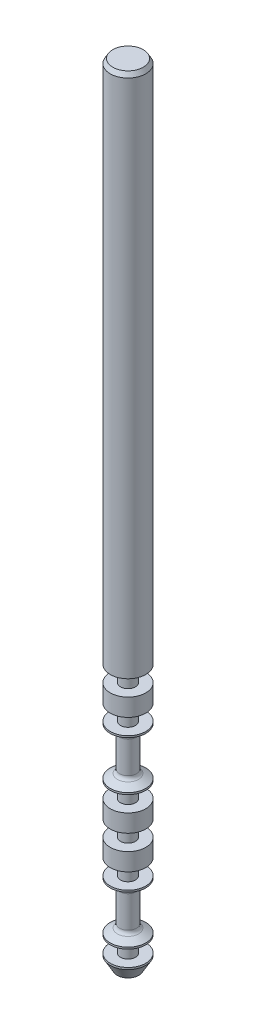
ISO-10303-21;
HEADER;
FILE_DESCRIPTION(('STEP AP214'),'2;1');
FILE_NAME('part.step','',(''),(''),'','','');
FILE_SCHEMA(('AUTOMOTIVE_DESIGN { 1 0 10303 214 1 1 1 1 }'));
ENDSEC;
DATA;
#1=APPLICATION_CONTEXT('core data for automotive mechanical design processes');
#2=APPLICATION_PROTOCOL_DEFINITION('international standard','automotive_design',2000,#1);
#3=PRODUCT_CONTEXT('',#1,'mechanical');
#4=PRODUCT('Part','Part','',(#3));
#5=PRODUCT_RELATED_PRODUCT_CATEGORY('part','',(#4));
#6=PRODUCT_DEFINITION_FORMATION('','',#4);
#7=PRODUCT_DEFINITION_CONTEXT('part definition',#1,'design');
#8=PRODUCT_DEFINITION('design','',#6,#7);
#9=PRODUCT_DEFINITION_SHAPE('','',#8);
#10=(LENGTH_UNIT() NAMED_UNIT(*) SI_UNIT(.MILLI.,.METRE.));
#11=(NAMED_UNIT(*) PLANE_ANGLE_UNIT() SI_UNIT($,.RADIAN.));
#12=(NAMED_UNIT(*) SI_UNIT($,.STERADIAN.) SOLID_ANGLE_UNIT());
#13=UNCERTAINTY_MEASURE_WITH_UNIT(LENGTH_MEASURE(1.E-05),#10,'distance_accuracy_value','');
#14=(GEOMETRIC_REPRESENTATION_CONTEXT(3) GLOBAL_UNCERTAINTY_ASSIGNED_CONTEXT((#13)) GLOBAL_UNIT_ASSIGNED_CONTEXT((#10,
#11,#12)) REPRESENTATION_CONTEXT('',''));
#15=CARTESIAN_POINT('',(0.,0.,0.));
#16=DIRECTION('',(0.,0.,1.));
#17=DIRECTION('',(1.,0.,0.));
#18=AXIS2_PLACEMENT_3D('',#15,#16,#17);
#19=CARTESIAN_POINT('',(58.02,-2.4,1.65));
#20=DIRECTION('',(0.,1.,0.));
#21=DIRECTION('',(0.,0.,1.));
#22=AXIS2_PLACEMENT_3D('',#19,#20,#21);
#23=PLANE('',#22);
#24=CARTESIAN_POINT('',(56.,-2.4,1.65));
#25=DIRECTION('',(0.,1.,0.));
#26=DIRECTION('',(0.,0.,1.));
#27=AXIS2_PLACEMENT_3D('',#24,#25,#26);
#28=CIRCLE('',#27,1.73132486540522);
#29=CARTESIAN_POINT('',(56.,-2.4,3.38132486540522));
#30=VERTEX_POINT('',#29);
#31=EDGE_CURVE('E10',#30,#30,#28,.T.);
#32=ORIENTED_EDGE('',*,*,#31,.T.);
#33=EDGE_LOOP('',(#32));
#34=FACE_BOUND('',#33,.T.);
#35=ADVANCED_FACE('F37',(#34),#23,.T.);
#36=CARTESIAN_POINT('',(56.,-1065.45754338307,1.65));
#37=DIRECTION('',(0.,-1.,0.));
#38=DIRECTION('',(0.,0.,-1.));
#39=AXIS2_PLACEMENT_3D('',#36,#37,#38);
#40=CYLINDRICAL_SURFACE('',#39,2.02);
#41=CARTESIAN_POINT('',(56.,-2.8999999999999,1.65));
#42=DIRECTION('',(0.,1.,0.));
#43=DIRECTION('',(0.,0.,1.));
#44=AXIS2_PLACEMENT_3D('',#41,#42,#43);
#45=CIRCLE('',#44,2.02);
#46=CARTESIAN_POINT('',(56.,-2.8999999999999,3.67));
#47=VERTEX_POINT('',#46);
#48=EDGE_CURVE('E45',#47,#47,#45,.F.);
#49=ORIENTED_EDGE('',*,*,#48,.T.);
#50=EDGE_LOOP('',(#49));
#51=FACE_BOUND('',#50,.T.);
#52=CARTESIAN_POINT('',(56.,-62.0000000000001,1.65));
#53=DIRECTION('',(0.,-1.,0.));
#54=DIRECTION('',(0.,0.,-1.));
#55=AXIS2_PLACEMENT_3D('',#52,#53,#54);
#56=CIRCLE('',#55,2.02000000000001);
#57=CARTESIAN_POINT('',(56.,-62.0000000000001,-0.370000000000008));
#58=VERTEX_POINT('',#57);
#59=EDGE_CURVE('E93',#58,#58,#56,.T.);
#60=ORIENTED_EDGE('',*,*,#59,.F.);
#61=EDGE_LOOP('',(#60));
#62=FACE_BOUND('',#61,.T.);
#63=ADVANCED_FACE('F224',(#51,#62),#40,.T.);
#64=CARTESIAN_POINT('',(56.85,-62.,1.65));
#65=DIRECTION('',(0.,-1.,0.));
#66=DIRECTION('',(0.,0.,-1.));
#67=AXIS2_PLACEMENT_3D('',#64,#65,#66);
#68=PLANE('',#67);
#69=ORIENTED_EDGE('',*,*,#59,.T.);
#70=EDGE_LOOP('',(#69));
#71=FACE_BOUND('',#70,.T.);
#72=CARTESIAN_POINT('',(56.,-62.0000000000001,1.65));
#73=DIRECTION('',(0.,-1.,0.));
#74=DIRECTION('',(0.,0.,-1.));
#75=AXIS2_PLACEMENT_3D('',#72,#73,#74);
#76=CIRCLE('',#75,0.849999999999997);
#77=CARTESIAN_POINT('',(56.,-62.0000000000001,0.800000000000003));
#78=VERTEX_POINT('',#77);
#79=EDGE_CURVE('E97',#78,#78,#76,.T.);
#80=ORIENTED_EDGE('',*,*,#79,.F.);
#81=EDGE_LOOP('',(#80));
#82=FACE_BOUND('',#81,.T.);
#83=ADVANCED_FACE('F229',(#71,#82),#68,.T.);
#84=CARTESIAN_POINT('',(56.,-1065.45754338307,1.65));
#85=DIRECTION('',(0.,-1.,0.));
#86=DIRECTION('',(0.,0.,-1.));
#87=AXIS2_PLACEMENT_3D('',#84,#85,#86);
#88=CYLINDRICAL_SURFACE('',#87,0.849999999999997);
#89=ORIENTED_EDGE('',*,*,#79,.T.);
#90=EDGE_LOOP('',(#89));
#91=FACE_BOUND('',#90,.T.);
#92=CARTESIAN_POINT('',(56.,-63.8000000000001,1.65));
#93=DIRECTION('',(0.,-1.,0.));
#94=DIRECTION('',(0.,0.,-1.));
#95=AXIS2_PLACEMENT_3D('',#92,#93,#94);
#96=CIRCLE('',#95,0.849999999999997);
#97=CARTESIAN_POINT('',(56.,-63.8000000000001,0.800000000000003));
#98=VERTEX_POINT('',#97);
#99=EDGE_CURVE('E101',#98,#98,#96,.T.);
#100=ORIENTED_EDGE('',*,*,#99,.F.);
#101=EDGE_LOOP('',(#100));
#102=FACE_BOUND('',#101,.T.);
#103=ADVANCED_FACE('F547',(#91,#102),#88,.T.);
#104=CARTESIAN_POINT('',(58.02,-63.8,1.65));
#105=DIRECTION('',(0.,1.,0.));
#106=DIRECTION('',(0.,0.,1.));
#107=AXIS2_PLACEMENT_3D('',#104,#105,#106);
#108=PLANE('',#107);
#109=ORIENTED_EDGE('',*,*,#99,.T.);
#110=EDGE_LOOP('',(#109));
#111=FACE_BOUND('',#110,.T.);
#112=CARTESIAN_POINT('',(56.,-63.8000000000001,1.65));
#113=DIRECTION('',(0.,-1.,0.));
#114=DIRECTION('',(0.,0.,-1.));
#115=AXIS2_PLACEMENT_3D('',#112,#113,#114);
#116=CIRCLE('',#115,2.02);
#117=CARTESIAN_POINT('',(56.,-63.8000000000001,-0.370000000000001));
#118=VERTEX_POINT('',#117);
#119=EDGE_CURVE('E105',#118,#118,#116,.T.);
#120=ORIENTED_EDGE('',*,*,#119,.F.);
#121=EDGE_LOOP('',(#120));
#122=FACE_BOUND('',#121,.T.);
#123=ADVANCED_FACE('F538',(#111,#122),#108,.T.);
#124=CARTESIAN_POINT('',(56.,-1065.45754338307,1.65));
#125=DIRECTION('',(0.,-1.,0.));
#126=DIRECTION('',(0.,0.,-1.));
#127=AXIS2_PLACEMENT_3D('',#124,#125,#126);
#128=CYLINDRICAL_SURFACE('',#127,2.02);
#129=ORIENTED_EDGE('',*,*,#119,.T.);
#130=EDGE_LOOP('',(#129));
#131=FACE_BOUND('',#130,.T.);
#132=CARTESIAN_POINT('',(56.,-65.8,1.65));
#133=DIRECTION('',(0.,-1.,0.));
#134=DIRECTION('',(0.,0.,-1.));
#135=AXIS2_PLACEMENT_3D('',#132,#133,#134);
#136=CIRCLE('',#135,2.02);
#137=CARTESIAN_POINT('',(56.,-65.8,-0.370000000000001));
#138=VERTEX_POINT('',#137);
#139=EDGE_CURVE('E109',#138,#138,#136,.T.);
#140=ORIENTED_EDGE('',*,*,#139,.F.);
#141=EDGE_LOOP('',(#140));
#142=FACE_BOUND('',#141,.T.);
#143=ADVANCED_FACE('F529',(#131,#142),#128,.T.);
#144=CARTESIAN_POINT('',(58.02,-65.8,1.65));
#145=DIRECTION('',(0.,-1.,0.));
#146=DIRECTION('',(0.,0.,-1.));
#147=AXIS2_PLACEMENT_3D('',#144,#145,#146);
#148=PLANE('',#147);
#149=ORIENTED_EDGE('',*,*,#139,.T.);
#150=EDGE_LOOP('',(#149));
#151=FACE_BOUND('',#150,.T.);
#152=CARTESIAN_POINT('',(56.,-65.8,1.65));
#153=DIRECTION('',(0.,-1.,0.));
#154=DIRECTION('',(0.,0.,-1.));
#155=AXIS2_PLACEMENT_3D('',#152,#153,#154);
#156=CIRCLE('',#155,0.849999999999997);
#157=CARTESIAN_POINT('',(56.,-65.8,0.800000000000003));
#158=VERTEX_POINT('',#157);
#159=EDGE_CURVE('E113',#158,#158,#156,.T.);
#160=ORIENTED_EDGE('',*,*,#159,.F.);
#161=EDGE_LOOP('',(#160));
#162=FACE_BOUND('',#161,.T.);
#163=ADVANCED_FACE('F520',(#151,#162),#148,.T.);
#164=CARTESIAN_POINT('',(56.,-1065.45754338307,1.65));
#165=DIRECTION('',(0.,-1.,0.));
#166=DIRECTION('',(0.,0.,-1.));
#167=AXIS2_PLACEMENT_3D('',#164,#165,#166);
#168=CYLINDRICAL_SURFACE('',#167,0.849999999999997);
#169=ORIENTED_EDGE('',*,*,#159,.T.);
#170=EDGE_LOOP('',(#169));
#171=FACE_BOUND('',#170,.T.);
#172=CARTESIAN_POINT('',(56.,-67.6,1.65));
#173=DIRECTION('',(0.,-1.,0.));
#174=DIRECTION('',(0.,0.,-1.));
#175=AXIS2_PLACEMENT_3D('',#172,#173,#174);
#176=CIRCLE('',#175,0.849999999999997);
#177=CARTESIAN_POINT('',(56.,-67.6,0.800000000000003));
#178=VERTEX_POINT('',#177);
#179=EDGE_CURVE('E117',#178,#178,#176,.T.);
#180=ORIENTED_EDGE('',*,*,#179,.F.);
#181=EDGE_LOOP('',(#180));
#182=FACE_BOUND('',#181,.T.);
#183=ADVANCED_FACE('F511',(#171,#182),#168,.T.);
#184=CARTESIAN_POINT('',(56.85,-67.6,1.65));
#185=DIRECTION('',(0.,1.,0.));
#186=DIRECTION('',(0.,0.,1.));
#187=AXIS2_PLACEMENT_3D('',#184,#185,#186);
#188=PLANE('',#187);
#189=ORIENTED_EDGE('',*,*,#179,.T.);
#190=EDGE_LOOP('',(#189));
#191=FACE_BOUND('',#190,.T.);
#192=CARTESIAN_POINT('',(56.,-67.6,1.65));
#193=DIRECTION('',(0.,-1.,0.));
#194=DIRECTION('',(0.,0.,-1.));
#195=AXIS2_PLACEMENT_3D('',#192,#193,#194);
#196=CIRCLE('',#195,2.02);
#197=CARTESIAN_POINT('',(56.,-67.6,-0.370000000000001));
#198=VERTEX_POINT('',#197);
#199=EDGE_CURVE('E121',#198,#198,#196,.T.);
#200=ORIENTED_EDGE('',*,*,#199,.F.);
#201=EDGE_LOOP('',(#200));
#202=FACE_BOUND('',#201,.T.);
#203=ADVANCED_FACE('F502',(#191,#202),#188,.T.);
#204=CARTESIAN_POINT('',(56.,-1065.45754338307,1.65));
#205=DIRECTION('',(0.,-1.,0.));
#206=DIRECTION('',(0.,0.,-1.));
#207=AXIS2_PLACEMENT_3D('',#204,#205,#206);
#208=CYLINDRICAL_SURFACE('',#207,2.02);
#209=ORIENTED_EDGE('',*,*,#199,.T.);
#210=EDGE_LOOP('',(#209));
#211=FACE_BOUND('',#210,.T.);
#212=CARTESIAN_POINT('',(56.,-67.8,1.65));
#213=DIRECTION('',(0.,-1.,0.));
#214=DIRECTION('',(0.,0.,-1.));
#215=AXIS2_PLACEMENT_3D('',#212,#213,#214);
#216=CIRCLE('',#215,2.02);
#217=CARTESIAN_POINT('',(56.,-67.8,-0.370000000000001));
#218=VERTEX_POINT('',#217);
#219=EDGE_CURVE('E125',#218,#218,#216,.T.);
#220=ORIENTED_EDGE('',*,*,#219,.F.);
#221=EDGE_LOOP('',(#220));
#222=FACE_BOUND('',#221,.T.);
#223=ADVANCED_FACE('F494',(#211,#222),#208,.T.);
#224=CARTESIAN_POINT('',(56.,-68.4177647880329,1.65));
#225=DIRECTION('',(0.,1.,0.));
#226=DIRECTION('',(0.,0.,1.));
#227=AXIS2_PLACEMENT_3D('',#224,#225,#226);
#228=CONICAL_SURFACE('',#227,0.95,1.04719755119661);
#229=CARTESIAN_POINT('',(56.,-68.2734272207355,1.65));
#230=DIRECTION('',(0.,1.,0.));
#231=DIRECTION('',(0.,0.,1.));
#232=AXIS2_PLACEMENT_3D('',#229,#230,#231);
#233=CIRCLE('',#232,1.19999999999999);
#234=CARTESIAN_POINT('',(56.,-68.2734272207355,2.84999999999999));
#235=VERTEX_POINT('',#234);
#236=EDGE_CURVE('E61',#235,#235,#233,.T.);
#237=ORIENTED_EDGE('',*,*,#236,.T.);
#238=EDGE_LOOP('',(#237));
#239=FACE_BOUND('',#238,.T.);
#240=ORIENTED_EDGE('',*,*,#219,.T.);
#241=EDGE_LOOP('',(#240));
#242=FACE_BOUND('',#241,.T.);
#243=ADVANCED_FACE('F486',(#239,#242),#228,.T.);
#244=CARTESIAN_POINT('',(56.,-1065.45754338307,1.65));
#245=DIRECTION('',(0.,-1.,0.));
#246=DIRECTION('',(0.,0.,-1.));
#247=AXIS2_PLACEMENT_3D('',#244,#245,#246);
#248=CYLINDRICAL_SURFACE('',#247,0.95);
#249=CARTESIAN_POINT('',(56.,-72.2935600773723,1.65));
#250=DIRECTION('',(0.,-1.,0.));
#251=DIRECTION('',(0.,0.,-1.));
#252=AXIS2_PLACEMENT_3D('',#249,#250,#251);
#253=CIRCLE('',#252,0.95);
#254=CARTESIAN_POINT('',(56.,-72.2935600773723,0.700000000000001));
#255=VERTEX_POINT('',#254);
#256=EDGE_CURVE('E65',#255,#255,#253,.F.);
#257=ORIENTED_EDGE('',*,*,#256,.T.);
#258=EDGE_LOOP('',(#257));
#259=FACE_BOUND('',#258,.T.);
#260=CARTESIAN_POINT('',(56.,-68.7064399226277,1.65));
#261=DIRECTION('',(0.,-1.,0.));
#262=DIRECTION('',(0.,0.,-1.));
#263=AXIS2_PLACEMENT_3D('',#260,#261,#262);
#264=CIRCLE('',#263,0.95);
#265=CARTESIAN_POINT('',(56.,-68.7064399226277,0.700000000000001));
#266=VERTEX_POINT('',#265);
#267=EDGE_CURVE('E69',#266,#266,#264,.T.);
#268=ORIENTED_EDGE('',*,*,#267,.T.);
#269=EDGE_LOOP('',(#268));
#270=FACE_BOUND('',#269,.T.);
#271=ADVANCED_FACE('F477',(#259,#270),#248,.T.);
#272=CARTESIAN_POINT('',(56.,-73.2,1.65));
#273=DIRECTION('',(0.,-1.,0.));
#274=DIRECTION('',(0.,0.,-1.));
#275=AXIS2_PLACEMENT_3D('',#272,#273,#274);
#276=CONICAL_SURFACE('',#275,2.02,1.04719755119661);
#277=CARTESIAN_POINT('',(56.,-72.7265727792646,1.65));
#278=DIRECTION('',(0.,-1.,0.));
#279=DIRECTION('',(0.,0.,-1.));
#280=AXIS2_PLACEMENT_3D('',#277,#278,#279);
#281=CIRCLE('',#280,1.19999999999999);
#282=CARTESIAN_POINT('',(56.,-72.7265727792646,0.450000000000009));
#283=VERTEX_POINT('',#282);
#284=EDGE_CURVE('E73',#283,#283,#281,.T.);
#285=ORIENTED_EDGE('',*,*,#284,.T.);
#286=EDGE_LOOP('',(#285));
#287=FACE_BOUND('',#286,.T.);
#288=CARTESIAN_POINT('',(56.,-73.2,1.65));
#289=DIRECTION('',(0.,-1.,0.));
#290=DIRECTION('',(0.,0.,-1.));
#291=AXIS2_PLACEMENT_3D('',#288,#289,#290);
#292=CIRCLE('',#291,2.02);
#293=CARTESIAN_POINT('',(56.,-73.2,-0.370000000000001));
#294=VERTEX_POINT('',#293);
#295=EDGE_CURVE('E129',#294,#294,#292,.T.);
#296=ORIENTED_EDGE('',*,*,#295,.F.);
#297=EDGE_LOOP('',(#296));
#298=FACE_BOUND('',#297,.T.);
#299=ADVANCED_FACE('F468',(#287,#298),#276,.T.);
#300=CARTESIAN_POINT('',(56.,-1065.45754338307,1.65));
#301=DIRECTION('',(0.,-1.,0.));
#302=DIRECTION('',(0.,0.,-1.));
#303=AXIS2_PLACEMENT_3D('',#300,#301,#302);
#304=CYLINDRICAL_SURFACE('',#303,2.02);
#305=ORIENTED_EDGE('',*,*,#295,.T.);
#306=EDGE_LOOP('',(#305));
#307=FACE_BOUND('',#306,.T.);
#308=CARTESIAN_POINT('',(56.,-73.4,1.65));
#309=DIRECTION('',(0.,-1.,0.));
#310=DIRECTION('',(0.,0.,-1.));
#311=AXIS2_PLACEMENT_3D('',#308,#309,#310);
#312=CIRCLE('',#311,2.02);
#313=CARTESIAN_POINT('',(56.,-73.4,-0.370000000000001));
#314=VERTEX_POINT('',#313);
#315=EDGE_CURVE('E133',#314,#314,#312,.T.);
#316=ORIENTED_EDGE('',*,*,#315,.F.);
#317=EDGE_LOOP('',(#316));
#318=FACE_BOUND('',#317,.T.);
#319=ADVANCED_FACE('F459',(#307,#318),#304,.T.);
#320=CARTESIAN_POINT('',(58.02,-73.4,1.65));
#321=DIRECTION('',(0.,-1.,0.));
#322=DIRECTION('',(0.,0.,-1.));
#323=AXIS2_PLACEMENT_3D('',#320,#321,#322);
#324=PLANE('',#323);
#325=ORIENTED_EDGE('',*,*,#315,.T.);
#326=EDGE_LOOP('',(#325));
#327=FACE_BOUND('',#326,.T.);
#328=CARTESIAN_POINT('',(56.,-73.4,1.65));
#329=DIRECTION('',(0.,-1.,0.));
#330=DIRECTION('',(0.,0.,-1.));
#331=AXIS2_PLACEMENT_3D('',#328,#329,#330);
#332=CIRCLE('',#331,0.849999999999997);
#333=CARTESIAN_POINT('',(56.,-73.4,0.800000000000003));
#334=VERTEX_POINT('',#333);
#335=EDGE_CURVE('E137',#334,#334,#332,.T.);
#336=ORIENTED_EDGE('',*,*,#335,.F.);
#337=EDGE_LOOP('',(#336));
#338=FACE_BOUND('',#337,.T.);
#339=ADVANCED_FACE('F450',(#327,#338),#324,.T.);
#340=CARTESIAN_POINT('',(56.,-1065.45754338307,1.65));
#341=DIRECTION('',(0.,-1.,0.));
#342=DIRECTION('',(0.,0.,-1.));
#343=AXIS2_PLACEMENT_3D('',#340,#341,#342);
#344=CYLINDRICAL_SURFACE('',#343,0.849999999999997);
#345=ORIENTED_EDGE('',*,*,#335,.T.);
#346=EDGE_LOOP('',(#345));
#347=FACE_BOUND('',#346,.T.);
#348=CARTESIAN_POINT('',(56.,-75.2,1.65));
#349=DIRECTION('',(0.,-1.,0.));
#350=DIRECTION('',(0.,0.,-1.));
#351=AXIS2_PLACEMENT_3D('',#348,#349,#350);
#352=CIRCLE('',#351,0.849999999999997);
#353=CARTESIAN_POINT('',(56.,-75.2,0.800000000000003));
#354=VERTEX_POINT('',#353);
#355=EDGE_CURVE('E141',#354,#354,#352,.T.);
#356=ORIENTED_EDGE('',*,*,#355,.F.);
#357=EDGE_LOOP('',(#356));
#358=FACE_BOUND('',#357,.T.);
#359=ADVANCED_FACE('F441',(#347,#358),#344,.T.);
#360=CARTESIAN_POINT('',(56.85,-75.2,1.65));
#361=DIRECTION('',(0.,1.,0.));
#362=DIRECTION('',(0.,0.,1.));
#363=AXIS2_PLACEMENT_3D('',#360,#361,#362);
#364=PLANE('',#363);
#365=ORIENTED_EDGE('',*,*,#355,.T.);
#366=EDGE_LOOP('',(#365));
#367=FACE_BOUND('',#366,.T.);
#368=CARTESIAN_POINT('',(56.,-75.2,1.65));
#369=DIRECTION('',(0.,-1.,0.));
#370=DIRECTION('',(0.,0.,-1.));
#371=AXIS2_PLACEMENT_3D('',#368,#369,#370);
#372=CIRCLE('',#371,2.02);
#373=CARTESIAN_POINT('',(56.,-75.2,-0.370000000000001));
#374=VERTEX_POINT('',#373);
#375=EDGE_CURVE('E145',#374,#374,#372,.T.);
#376=ORIENTED_EDGE('',*,*,#375,.F.);
#377=EDGE_LOOP('',(#376));
#378=FACE_BOUND('',#377,.T.);
#379=ADVANCED_FACE('F432',(#367,#378),#364,.T.);
#380=CARTESIAN_POINT('',(56.,-1065.45754338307,1.65));
#381=DIRECTION('',(0.,-1.,0.));
#382=DIRECTION('',(0.,0.,-1.));
#383=AXIS2_PLACEMENT_3D('',#380,#381,#382);
#384=CYLINDRICAL_SURFACE('',#383,2.02);
#385=ORIENTED_EDGE('',*,*,#375,.T.);
#386=EDGE_LOOP('',(#385));
#387=FACE_BOUND('',#386,.T.);
#388=CARTESIAN_POINT('',(56.,-77.2,1.65));
#389=DIRECTION('',(0.,-1.,0.));
#390=DIRECTION('',(0.,0.,-1.));
#391=AXIS2_PLACEMENT_3D('',#388,#389,#390);
#392=CIRCLE('',#391,2.02);
#393=CARTESIAN_POINT('',(56.,-77.2,-0.370000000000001));
#394=VERTEX_POINT('',#393);
#395=EDGE_CURVE('E149',#394,#394,#392,.T.);
#396=ORIENTED_EDGE('',*,*,#395,.F.);
#397=EDGE_LOOP('',(#396));
#398=FACE_BOUND('',#397,.T.);
#399=ADVANCED_FACE('F423',(#387,#398),#384,.T.);
#400=CARTESIAN_POINT('',(58.02,-77.2,1.65));
#401=DIRECTION('',(0.,-1.,0.));
#402=DIRECTION('',(0.,0.,-1.));
#403=AXIS2_PLACEMENT_3D('',#400,#401,#402);
#404=PLANE('',#403);
#405=ORIENTED_EDGE('',*,*,#395,.T.);
#406=EDGE_LOOP('',(#405));
#407=FACE_BOUND('',#406,.T.);
#408=CARTESIAN_POINT('',(56.,-77.2,1.65));
#409=DIRECTION('',(0.,-1.,0.));
#410=DIRECTION('',(0.,0.,-1.));
#411=AXIS2_PLACEMENT_3D('',#408,#409,#410);
#412=CIRCLE('',#411,0.849999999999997);
#413=CARTESIAN_POINT('',(56.,-77.2,0.800000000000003));
#414=VERTEX_POINT('',#413);
#415=EDGE_CURVE('E153',#414,#414,#412,.T.);
#416=ORIENTED_EDGE('',*,*,#415,.F.);
#417=EDGE_LOOP('',(#416));
#418=FACE_BOUND('',#417,.T.);
#419=ADVANCED_FACE('F414',(#407,#418),#404,.T.);
#420=CARTESIAN_POINT('',(56.,-1065.45754338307,1.65));
#421=DIRECTION('',(0.,-1.,0.));
#422=DIRECTION('',(0.,0.,-1.));
#423=AXIS2_PLACEMENT_3D('',#420,#421,#422);
#424=CYLINDRICAL_SURFACE('',#423,0.849999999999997);
#425=ORIENTED_EDGE('',*,*,#415,.T.);
#426=EDGE_LOOP('',(#425));
#427=FACE_BOUND('',#426,.T.);
#428=CARTESIAN_POINT('',(56.,-79.,1.65));
#429=DIRECTION('',(0.,-1.,0.));
#430=DIRECTION('',(0.,0.,-1.));
#431=AXIS2_PLACEMENT_3D('',#428,#429,#430);
#432=CIRCLE('',#431,0.849999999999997);
#433=CARTESIAN_POINT('',(56.,-79.,0.800000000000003));
#434=VERTEX_POINT('',#433);
#435=EDGE_CURVE('E157',#434,#434,#432,.T.);
#436=ORIENTED_EDGE('',*,*,#435,.F.);
#437=EDGE_LOOP('',(#436));
#438=FACE_BOUND('',#437,.T.);
#439=ADVANCED_FACE('F405',(#427,#438),#424,.T.);
#440=CARTESIAN_POINT('',(56.85,-79.,1.65));
#441=DIRECTION('',(0.,1.,0.));
#442=DIRECTION('',(0.,0.,1.));
#443=AXIS2_PLACEMENT_3D('',#440,#441,#442);
#444=PLANE('',#443);
#445=ORIENTED_EDGE('',*,*,#435,.T.);
#446=EDGE_LOOP('',(#445));
#447=FACE_BOUND('',#446,.T.);
#448=CARTESIAN_POINT('',(56.,-79.,1.65));
#449=DIRECTION('',(0.,-1.,0.));
#450=DIRECTION('',(0.,0.,-1.));
#451=AXIS2_PLACEMENT_3D('',#448,#449,#450);
#452=CIRCLE('',#451,2.02);
#453=CARTESIAN_POINT('',(56.,-79.,-0.370000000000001));
#454=VERTEX_POINT('',#453);
#455=EDGE_CURVE('E161',#454,#454,#452,.T.);
#456=ORIENTED_EDGE('',*,*,#455,.F.);
#457=EDGE_LOOP('',(#456));
#458=FACE_BOUND('',#457,.T.);
#459=ADVANCED_FACE('F396',(#447,#458),#444,.T.);
#460=CARTESIAN_POINT('',(56.,-1065.45754338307,1.65));
#461=DIRECTION('',(0.,-1.,0.));
#462=DIRECTION('',(0.,0.,-1.));
#463=AXIS2_PLACEMENT_3D('',#460,#461,#462);
#464=CYLINDRICAL_SURFACE('',#463,2.02);
#465=ORIENTED_EDGE('',*,*,#455,.T.);
#466=EDGE_LOOP('',(#465));
#467=FACE_BOUND('',#466,.T.);
#468=CARTESIAN_POINT('',(56.,-81.,1.65));
#469=DIRECTION('',(0.,-1.,0.));
#470=DIRECTION('',(0.,0.,-1.));
#471=AXIS2_PLACEMENT_3D('',#468,#469,#470);
#472=CIRCLE('',#471,2.02);
#473=CARTESIAN_POINT('',(56.,-81.,-0.370000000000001));
#474=VERTEX_POINT('',#473);
#475=EDGE_CURVE('E165',#474,#474,#472,.T.);
#476=ORIENTED_EDGE('',*,*,#475,.F.);
#477=EDGE_LOOP('',(#476));
#478=FACE_BOUND('',#477,.T.);
#479=ADVANCED_FACE('F387',(#467,#478),#464,.T.);
#480=CARTESIAN_POINT('',(58.02,-81.,1.65));
#481=DIRECTION('',(0.,-1.,0.));
#482=DIRECTION('',(0.,0.,-1.));
#483=AXIS2_PLACEMENT_3D('',#480,#481,#482);
#484=PLANE('',#483);
#485=ORIENTED_EDGE('',*,*,#475,.T.);
#486=EDGE_LOOP('',(#485));
#487=FACE_BOUND('',#486,.T.);
#488=CARTESIAN_POINT('',(56.,-81.0000000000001,1.65));
#489=DIRECTION('',(0.,-1.,0.));
#490=DIRECTION('',(0.,0.,-1.));
#491=AXIS2_PLACEMENT_3D('',#488,#489,#490);
#492=CIRCLE('',#491,0.849999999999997);
#493=CARTESIAN_POINT('',(56.,-81.0000000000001,0.800000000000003));
#494=VERTEX_POINT('',#493);
#495=EDGE_CURVE('E169',#494,#494,#492,.T.);
#496=ORIENTED_EDGE('',*,*,#495,.F.);
#497=EDGE_LOOP('',(#496));
#498=FACE_BOUND('',#497,.T.);
#499=ADVANCED_FACE('F378',(#487,#498),#484,.T.);
#500=CARTESIAN_POINT('',(56.,-1065.45754338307,1.65));
#501=DIRECTION('',(0.,-1.,0.));
#502=DIRECTION('',(0.,0.,-1.));
#503=AXIS2_PLACEMENT_3D('',#500,#501,#502);
#504=CYLINDRICAL_SURFACE('',#503,0.849999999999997);
#505=ORIENTED_EDGE('',*,*,#495,.T.);
#506=EDGE_LOOP('',(#505));
#507=FACE_BOUND('',#506,.T.);
#508=CARTESIAN_POINT('',(56.,-82.8,1.65));
#509=DIRECTION('',(0.,-1.,0.));
#510=DIRECTION('',(0.,0.,-1.));
#511=AXIS2_PLACEMENT_3D('',#508,#509,#510);
#512=CIRCLE('',#511,0.849999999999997);
#513=CARTESIAN_POINT('',(56.,-82.8,0.800000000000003));
#514=VERTEX_POINT('',#513);
#515=EDGE_CURVE('E173',#514,#514,#512,.T.);
#516=ORIENTED_EDGE('',*,*,#515,.F.);
#517=EDGE_LOOP('',(#516));
#518=FACE_BOUND('',#517,.T.);
#519=ADVANCED_FACE('F369',(#507,#518),#504,.T.);
#520=CARTESIAN_POINT('',(56.85,-82.8,1.65));
#521=DIRECTION('',(0.,1.,0.));
#522=DIRECTION('',(0.,0.,1.));
#523=AXIS2_PLACEMENT_3D('',#520,#521,#522);
#524=PLANE('',#523);
#525=ORIENTED_EDGE('',*,*,#515,.T.);
#526=EDGE_LOOP('',(#525));
#527=FACE_BOUND('',#526,.T.);
#528=CARTESIAN_POINT('',(56.,-82.8,1.65));
#529=DIRECTION('',(0.,-1.,0.));
#530=DIRECTION('',(0.,0.,-1.));
#531=AXIS2_PLACEMENT_3D('',#528,#529,#530);
#532=CIRCLE('',#531,2.02000000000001);
#533=CARTESIAN_POINT('',(56.,-82.8,-0.370000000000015));
#534=VERTEX_POINT('',#533);
#535=EDGE_CURVE('E177',#534,#534,#532,.T.);
#536=ORIENTED_EDGE('',*,*,#535,.F.);
#537=EDGE_LOOP('',(#536));
#538=FACE_BOUND('',#537,.T.);
#539=ADVANCED_FACE('F360',(#527,#538),#524,.T.);
#540=CARTESIAN_POINT('',(56.,-1065.45754338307,1.65));
#541=DIRECTION('',(0.,-1.,0.));
#542=DIRECTION('',(0.,0.,-1.));
#543=AXIS2_PLACEMENT_3D('',#540,#541,#542);
#544=CYLINDRICAL_SURFACE('',#543,2.02000000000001);
#545=ORIENTED_EDGE('',*,*,#535,.T.);
#546=EDGE_LOOP('',(#545));
#547=FACE_BOUND('',#546,.T.);
#548=CARTESIAN_POINT('',(56.,-83.,1.65));
#549=DIRECTION('',(0.,-1.,0.));
#550=DIRECTION('',(0.,0.,-1.));
#551=AXIS2_PLACEMENT_3D('',#548,#549,#550);
#552=CIRCLE('',#551,2.02000000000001);
#553=CARTESIAN_POINT('',(56.,-83.,-0.370000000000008));
#554=VERTEX_POINT('',#553);
#555=EDGE_CURVE('E181',#554,#554,#552,.T.);
#556=ORIENTED_EDGE('',*,*,#555,.F.);
#557=EDGE_LOOP('',(#556));
#558=FACE_BOUND('',#557,.T.);
#559=ADVANCED_FACE('F351',(#547,#558),#544,.T.);
#560=CARTESIAN_POINT('',(56.,-83.617764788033,1.65));
#561=DIRECTION('',(0.,1.,0.));
#562=DIRECTION('',(0.,0.,1.));
#563=AXIS2_PLACEMENT_3D('',#560,#561,#562);
#564=CONICAL_SURFACE('',#563,0.95,1.04719755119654);
#565=CARTESIAN_POINT('',(56.,-83.4734272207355,1.65));
#566=DIRECTION('',(0.,1.,0.));
#567=DIRECTION('',(0.,0.,1.));
#568=AXIS2_PLACEMENT_3D('',#565,#566,#567);
#569=CIRCLE('',#568,1.19999999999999);
#570=CARTESIAN_POINT('',(56.,-83.4734272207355,2.84999999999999));
#571=VERTEX_POINT('',#570);
#572=EDGE_CURVE('E77',#571,#571,#569,.T.);
#573=ORIENTED_EDGE('',*,*,#572,.T.);
#574=EDGE_LOOP('',(#573));
#575=FACE_BOUND('',#574,.T.);
#576=ORIENTED_EDGE('',*,*,#555,.T.);
#577=EDGE_LOOP('',(#576));
#578=FACE_BOUND('',#577,.T.);
#579=ADVANCED_FACE('F342',(#575,#578),#564,.T.);
#580=CARTESIAN_POINT('',(56.,-1065.45754338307,1.65));
#581=DIRECTION('',(0.,-1.,0.));
#582=DIRECTION('',(0.,0.,-1.));
#583=AXIS2_PLACEMENT_3D('',#580,#581,#582);
#584=CYLINDRICAL_SURFACE('',#583,0.95);
#585=CARTESIAN_POINT('',(56.,-87.4935600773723,1.65));
#586=DIRECTION('',(0.,-1.,0.));
#587=DIRECTION('',(0.,0.,-1.));
#588=AXIS2_PLACEMENT_3D('',#585,#586,#587);
#589=CIRCLE('',#588,0.95);
#590=CARTESIAN_POINT('',(56.,-87.4935600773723,0.700000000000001));
#591=VERTEX_POINT('',#590);
#592=EDGE_CURVE('E81',#591,#591,#589,.F.);
#593=ORIENTED_EDGE('',*,*,#592,.T.);
#594=EDGE_LOOP('',(#593));
#595=FACE_BOUND('',#594,.T.);
#596=CARTESIAN_POINT('',(56.,-83.9064399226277,1.65));
#597=DIRECTION('',(0.,-1.,0.));
#598=DIRECTION('',(0.,0.,-1.));
#599=AXIS2_PLACEMENT_3D('',#596,#597,#598);
#600=CIRCLE('',#599,0.95);
#601=CARTESIAN_POINT('',(56.,-83.9064399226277,0.700000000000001));
#602=VERTEX_POINT('',#601);
#603=EDGE_CURVE('E85',#602,#602,#600,.T.);
#604=ORIENTED_EDGE('',*,*,#603,.T.);
#605=EDGE_LOOP('',(#604));
#606=FACE_BOUND('',#605,.T.);
#607=ADVANCED_FACE('F333',(#595,#606),#584,.T.);
#608=CARTESIAN_POINT('',(56.,-88.4,1.65));
#609=DIRECTION('',(0.,-1.,0.));
#610=DIRECTION('',(0.,0.,-1.));
#611=AXIS2_PLACEMENT_3D('',#608,#609,#610);
#612=CONICAL_SURFACE('',#611,2.02,1.04719755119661);
#613=CARTESIAN_POINT('',(56.,-87.9265727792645,1.65));
#614=DIRECTION('',(0.,-1.,0.));
#615=DIRECTION('',(0.,0.,-1.));
#616=AXIS2_PLACEMENT_3D('',#613,#614,#615);
#617=CIRCLE('',#616,1.19999999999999);
#618=CARTESIAN_POINT('',(56.,-87.9265727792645,0.450000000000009));
#619=VERTEX_POINT('',#618);
#620=EDGE_CURVE('E89',#619,#619,#617,.T.);
#621=ORIENTED_EDGE('',*,*,#620,.T.);
#622=EDGE_LOOP('',(#621));
#623=FACE_BOUND('',#622,.T.);
#624=CARTESIAN_POINT('',(56.,-88.4,1.65));
#625=DIRECTION('',(0.,-1.,0.));
#626=DIRECTION('',(0.,0.,-1.));
#627=AXIS2_PLACEMENT_3D('',#624,#625,#626);
#628=CIRCLE('',#627,2.02);
#629=CARTESIAN_POINT('',(56.,-88.4,-0.370000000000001));
#630=VERTEX_POINT('',#629);
#631=EDGE_CURVE('E185',#630,#630,#628,.T.);
#632=ORIENTED_EDGE('',*,*,#631,.F.);
#633=EDGE_LOOP('',(#632));
#634=FACE_BOUND('',#633,.T.);
#635=ADVANCED_FACE('F324',(#623,#634),#612,.T.);
#636=CARTESIAN_POINT('',(56.,-1065.45754338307,1.65));
#637=DIRECTION('',(0.,-1.,0.));
#638=DIRECTION('',(0.,0.,-1.));
#639=AXIS2_PLACEMENT_3D('',#636,#637,#638);
#640=CYLINDRICAL_SURFACE('',#639,2.02);
#641=ORIENTED_EDGE('',*,*,#631,.T.);
#642=EDGE_LOOP('',(#641));
#643=FACE_BOUND('',#642,.T.);
#644=CARTESIAN_POINT('',(56.,-88.6,1.65));
#645=DIRECTION('',(0.,-1.,0.));
#646=DIRECTION('',(0.,0.,-1.));
#647=AXIS2_PLACEMENT_3D('',#644,#645,#646);
#648=CIRCLE('',#647,2.02);
#649=CARTESIAN_POINT('',(56.,-88.6,-0.370000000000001));
#650=VERTEX_POINT('',#649);
#651=EDGE_CURVE('E189',#650,#650,#648,.T.);
#652=ORIENTED_EDGE('',*,*,#651,.F.);
#653=EDGE_LOOP('',(#652));
#654=FACE_BOUND('',#653,.T.);
#655=ADVANCED_FACE('F315',(#643,#654),#640,.T.);
#656=CARTESIAN_POINT('',(58.02,-88.6,1.65));
#657=DIRECTION('',(0.,-1.,0.));
#658=DIRECTION('',(0.,0.,-1.));
#659=AXIS2_PLACEMENT_3D('',#656,#657,#658);
#660=PLANE('',#659);
#661=ORIENTED_EDGE('',*,*,#651,.T.);
#662=EDGE_LOOP('',(#661));
#663=FACE_BOUND('',#662,.T.);
#664=CARTESIAN_POINT('',(56.,-88.6,1.65));
#665=DIRECTION('',(0.,-1.,0.));
#666=DIRECTION('',(0.,0.,-1.));
#667=AXIS2_PLACEMENT_3D('',#664,#665,#666);
#668=CIRCLE('',#667,0.849999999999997);
#669=CARTESIAN_POINT('',(56.,-88.6,0.800000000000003));
#670=VERTEX_POINT('',#669);
#671=EDGE_CURVE('E193',#670,#670,#668,.T.);
#672=ORIENTED_EDGE('',*,*,#671,.F.);
#673=EDGE_LOOP('',(#672));
#674=FACE_BOUND('',#673,.T.);
#675=ADVANCED_FACE('F220',(#663,#674),#660,.T.);
#676=CARTESIAN_POINT('',(56.,-1065.45754338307,1.65));
#677=DIRECTION('',(0.,-1.,0.));
#678=DIRECTION('',(0.,0.,-1.));
#679=AXIS2_PLACEMENT_3D('',#676,#677,#678);
#680=CYLINDRICAL_SURFACE('',#679,0.849999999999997);
#681=ORIENTED_EDGE('',*,*,#671,.T.);
#682=EDGE_LOOP('',(#681));
#683=FACE_BOUND('',#682,.T.);
#684=CARTESIAN_POINT('',(56.,-90.4,1.65));
#685=DIRECTION('',(0.,-1.,0.));
#686=DIRECTION('',(0.,0.,-1.));
#687=AXIS2_PLACEMENT_3D('',#684,#685,#686);
#688=CIRCLE('',#687,0.849999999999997);
#689=CARTESIAN_POINT('',(56.,-90.4,0.800000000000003));
#690=VERTEX_POINT('',#689);
#691=EDGE_CURVE('E197',#690,#690,#688,.T.);
#692=ORIENTED_EDGE('',*,*,#691,.F.);
#693=EDGE_LOOP('',(#692));
#694=FACE_BOUND('',#693,.T.);
#695=ADVANCED_FACE('F210',(#683,#694),#680,.T.);
#696=CARTESIAN_POINT('',(56.85,-90.4,1.65));
#697=DIRECTION('',(0.,1.,0.));
#698=DIRECTION('',(0.,0.,1.));
#699=AXIS2_PLACEMENT_3D('',#696,#697,#698);
#700=PLANE('',#699);
#701=ORIENTED_EDGE('',*,*,#691,.T.);
#702=EDGE_LOOP('',(#701));
#703=FACE_BOUND('',#702,.T.);
#704=CARTESIAN_POINT('',(56.,-90.4,1.65));
#705=DIRECTION('',(0.,-1.,0.));
#706=DIRECTION('',(0.,0.,-1.));
#707=AXIS2_PLACEMENT_3D('',#704,#705,#706);
#708=CIRCLE('',#707,2.02);
#709=CARTESIAN_POINT('',(56.,-90.4,-0.370000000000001));
#710=VERTEX_POINT('',#709);
#711=EDGE_CURVE('E201',#710,#710,#708,.T.);
#712=ORIENTED_EDGE('',*,*,#711,.F.);
#713=EDGE_LOOP('',(#712));
#714=FACE_BOUND('',#713,.T.);
#715=ADVANCED_FACE('F208',(#703,#714),#700,.T.);
#716=CARTESIAN_POINT('',(56.,-1065.45754338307,1.65));
#717=DIRECTION('',(0.,-1.,0.));
#718=DIRECTION('',(0.,0.,-1.));
#719=AXIS2_PLACEMENT_3D('',#716,#717,#718);
#720=CYLINDRICAL_SURFACE('',#719,2.02);
#721=CARTESIAN_POINT('',(56.,-90.6143593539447,1.65));
#722=DIRECTION('',(0.,-1.,0.));
#723=DIRECTION('',(0.,0.,-1.));
#724=AXIS2_PLACEMENT_3D('',#721,#722,#723);
#725=CIRCLE('',#724,2.02);
#726=CARTESIAN_POINT('',(56.,-90.6143593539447,-0.370000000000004));
#727=VERTEX_POINT('',#726);
#728=EDGE_CURVE('E50',#727,#727,#725,.F.);
#729=ORIENTED_EDGE('',*,*,#728,.T.);
#730=EDGE_LOOP('',(#729));
#731=FACE_BOUND('',#730,.T.);
#732=ORIENTED_EDGE('',*,*,#711,.T.);
#733=EDGE_LOOP('',(#732));
#734=FACE_BOUND('',#733,.T.);
#735=ADVANCED_FACE('F206',(#731,#734),#720,.T.);
#736=CARTESIAN_POINT('',(58.02,-92.,1.65));
#737=DIRECTION('',(0.,-1.,0.));
#738=DIRECTION('',(0.,0.,-1.));
#739=AXIS2_PLACEMENT_3D('',#736,#737,#738);
#740=PLANE('',#739);
#741=CARTESIAN_POINT('',(56.,-92.,1.65));
#742=DIRECTION('',(0.,-1.,0.));
#743=DIRECTION('',(0.,0.,-1.));
#744=AXIS2_PLACEMENT_3D('',#741,#742,#743);
#745=CIRCLE('',#744,1.21999999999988);
#746=CARTESIAN_POINT('',(56.,-92.,0.430000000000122));
#747=VERTEX_POINT('',#746);
#748=EDGE_CURVE('E55',#747,#747,#745,.T.);
#749=ORIENTED_EDGE('',*,*,#748,.T.);
#750=EDGE_LOOP('',(#749));
#751=FACE_BOUND('',#750,.T.);
#752=ADVANCED_FACE('F217',(#751),#740,.T.);
#753=CARTESIAN_POINT('',(56.,-87.4935600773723,1.65));
#754=DIRECTION('',(0.,-1.,0.));
#755=DIRECTION('',(0.,0.,-1.));
#756=AXIS2_PLACEMENT_3D('',#753,#754,#755);
#757=TOROIDAL_SURFACE('',#756,1.45,0.5);
#758=ORIENTED_EDGE('',*,*,#592,.F.);
#759=EDGE_LOOP('',(#758));
#760=FACE_BOUND('',#759,.T.);
#761=ORIENTED_EDGE('',*,*,#620,.F.);
#762=EDGE_LOOP('',(#761));
#763=FACE_BOUND('',#762,.T.);
#764=ADVANCED_FACE('F233',(#760,#763),#757,.F.);
#765=CARTESIAN_POINT('',(56.,-83.9064399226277,1.65));
#766=DIRECTION('',(0.,-1.,0.));
#767=DIRECTION('',(0.,0.,-1.));
#768=AXIS2_PLACEMENT_3D('',#765,#766,#767);
#769=TOROIDAL_SURFACE('',#768,1.45,0.5);
#770=ORIENTED_EDGE('',*,*,#572,.F.);
#771=EDGE_LOOP('',(#770));
#772=FACE_BOUND('',#771,.T.);
#773=ORIENTED_EDGE('',*,*,#603,.F.);
#774=EDGE_LOOP('',(#773));
#775=FACE_BOUND('',#774,.T.);
#776=ADVANCED_FACE('F236',(#772,#775),#769,.F.);
#777=CARTESIAN_POINT('',(56.,-72.2935600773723,1.65));
#778=DIRECTION('',(0.,-1.,0.));
#779=DIRECTION('',(0.,0.,-1.));
#780=AXIS2_PLACEMENT_3D('',#777,#778,#779);
#781=TOROIDAL_SURFACE('',#780,1.45,0.5);
#782=ORIENTED_EDGE('',*,*,#256,.F.);
#783=EDGE_LOOP('',(#782));
#784=FACE_BOUND('',#783,.T.);
#785=ORIENTED_EDGE('',*,*,#284,.F.);
#786=EDGE_LOOP('',(#785));
#787=FACE_BOUND('',#786,.T.);
#788=ADVANCED_FACE('F240',(#784,#787),#781,.F.);
#789=CARTESIAN_POINT('',(56.,-68.7064399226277,1.65));
#790=DIRECTION('',(0.,-1.,0.));
#791=DIRECTION('',(0.,0.,-1.));
#792=AXIS2_PLACEMENT_3D('',#789,#790,#791);
#793=TOROIDAL_SURFACE('',#792,1.45,0.5);
#794=ORIENTED_EDGE('',*,*,#236,.F.);
#795=EDGE_LOOP('',(#794));
#796=FACE_BOUND('',#795,.T.);
#797=ORIENTED_EDGE('',*,*,#267,.F.);
#798=EDGE_LOOP('',(#797));
#799=FACE_BOUND('',#798,.T.);
#800=ADVANCED_FACE('F244',(#796,#799),#793,.F.);
#801=CARTESIAN_POINT('',(56.,-92.,1.65));
#802=DIRECTION('',(0.,1.,0.));
#803=DIRECTION('',(0.,0.,1.));
#804=AXIS2_PLACEMENT_3D('',#801,#802,#803);
#805=CONICAL_SURFACE('',#804,1.2199999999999,0.523598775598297);
#806=ORIENTED_EDGE('',*,*,#728,.F.);
#807=EDGE_LOOP('',(#806));
#808=FACE_BOUND('',#807,.T.);
#809=ORIENTED_EDGE('',*,*,#748,.F.);
#810=EDGE_LOOP('',(#809));
#811=FACE_BOUND('',#810,.T.);
#812=ADVANCED_FACE('F247',(#808,#811),#805,.T.);
#813=CARTESIAN_POINT('',(56.,-2.8999999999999,1.65));
#814=DIRECTION('',(0.,-1.,0.));
#815=DIRECTION('',(0.,0.,-1.));
#816=AXIS2_PLACEMENT_3D('',#813,#814,#815);
#817=CONICAL_SURFACE('',#816,2.02,0.523598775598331);
#818=ORIENTED_EDGE('',*,*,#31,.F.);
#819=EDGE_LOOP('',(#818));
#820=FACE_BOUND('',#819,.T.);
#821=ORIENTED_EDGE('',*,*,#48,.F.);
#822=EDGE_LOOP('',(#821));
#823=FACE_BOUND('',#822,.T.);
#824=ADVANCED_FACE('F39',(#820,#823),#817,.T.);
#825=CLOSED_SHELL('',(#35,#63,#83,#103,#123,#143,#163,#183,#203,#223,#243,#271,#299,#319,#339,
#359,#379,#399,#419,#439,#459,#479,#499,#519,#539,#559,#579,#607,#635,#655,#675,#695,#715,#735,
#752,#764,#776,#788,#800,#812,#824));
#826=MANIFOLD_SOLID_BREP('B2',#825);
#827=ADVANCED_BREP_SHAPE_REPRESENTATION('',(#18,#826),#14);
#828=SHAPE_DEFINITION_REPRESENTATION(#9,#827);
ENDSEC;
END-ISO-10303-21;
